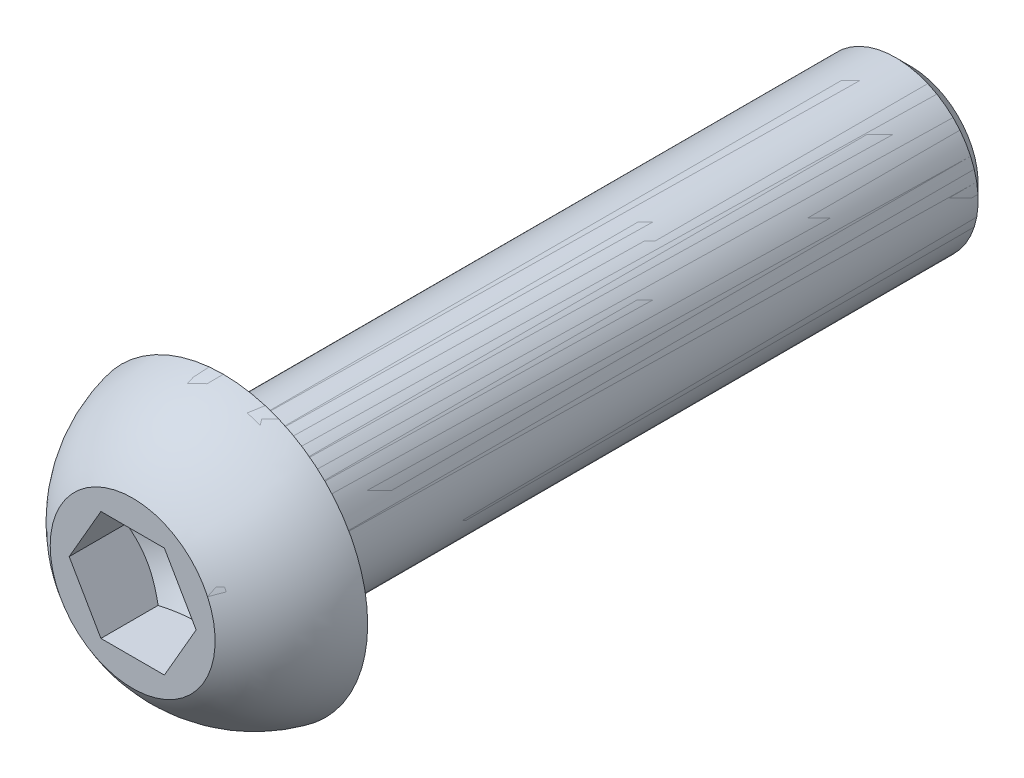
ISO-10303-21;
HEADER;
FILE_DESCRIPTION(('STEP AP214'),'2;1');
FILE_NAME('part.step','',(''),(''),'','','');
FILE_SCHEMA(('AUTOMOTIVE_DESIGN { 1 0 10303 214 1 1 1 1 }'));
ENDSEC;
DATA;
#1=APPLICATION_CONTEXT('core data for automotive mechanical design processes');
#2=APPLICATION_PROTOCOL_DEFINITION('international standard','automotive_design',2000,#1);
#3=PRODUCT_CONTEXT('',#1,'mechanical');
#4=PRODUCT('Part','Part','',(#3));
#5=PRODUCT_RELATED_PRODUCT_CATEGORY('part','',(#4));
#6=PRODUCT_DEFINITION_FORMATION('','',#4);
#7=PRODUCT_DEFINITION_CONTEXT('part definition',#1,'design');
#8=PRODUCT_DEFINITION('design','',#6,#7);
#9=PRODUCT_DEFINITION_SHAPE('','',#8);
#10=(LENGTH_UNIT() NAMED_UNIT(*) SI_UNIT(.MILLI.,.METRE.));
#11=(NAMED_UNIT(*) PLANE_ANGLE_UNIT() SI_UNIT($,.RADIAN.));
#12=(NAMED_UNIT(*) SI_UNIT($,.STERADIAN.) SOLID_ANGLE_UNIT());
#13=UNCERTAINTY_MEASURE_WITH_UNIT(LENGTH_MEASURE(1.E-05),#10,'distance_accuracy_value','');
#14=(GEOMETRIC_REPRESENTATION_CONTEXT(3) GLOBAL_UNCERTAINTY_ASSIGNED_CONTEXT((#13)) GLOBAL_UNIT_ASSIGNED_CONTEXT((#10,
#11,#12)) REPRESENTATION_CONTEXT('',''));
#15=CARTESIAN_POINT('',(0.,0.,0.));
#16=DIRECTION('',(0.,0.,1.));
#17=DIRECTION('',(1.,0.,0.));
#18=AXIS2_PLACEMENT_3D('',#15,#16,#17);
#19=CARTESIAN_POINT('',(0.,3.,3.3));
#20=DIRECTION('',(0.,0.,1.));
#21=DIRECTION('',(1.,0.,0.));
#22=AXIS2_PLACEMENT_3D('',#19,#20,#21);
#23=PLANE('',#22);
#24=CARTESIAN_POINT('',(0.,0.,3.3));
#25=DIRECTION('',(0.,0.,-1.));
#26=DIRECTION('',(-1.,0.,0.));
#27=AXIS2_PLACEMENT_3D('',#24,#25,#26);
#28=CIRCLE('',#27,3.);
#29=CARTESIAN_POINT('',(-3.,0.,3.3));
#30=VERTEX_POINT('',#29);
#31=EDGE_CURVE('P0_E449',#30,#30,#28,.T.);
#32=ORIENTED_EDGE('',*,*,#31,.F.);
#33=EDGE_LOOP('',(#32));
#34=FACE_BOUND('',#33,.T.);
#35=DIRECTION('',(1.,0.,0.));
#36=VECTOR('',#35,1.);
#37=CARTESIAN_POINT('',(-1.1547,1.99999906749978,3.3));
#38=LINE('',#37,#36);
#39=CARTESIAN_POINT('',(-1.1547,1.99999906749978,3.3));
#40=VERTEX_POINT('',#39);
#41=CARTESIAN_POINT('',(1.1547,1.99999906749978,3.3));
#42=VERTEX_POINT('',#41);
#43=EDGE_CURVE('P0_E431',#40,#42,#38,.T.);
#44=ORIENTED_EDGE('',*,*,#43,.T.);
#45=DIRECTION('',(0.5,-0.866025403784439,0.));
#46=VECTOR('',#45,1.);
#47=CARTESIAN_POINT('',(1.1547,1.99999906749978,3.3));
#48=LINE('',#47,#46);
#49=CARTESIAN_POINT('',(2.3094,0.,3.3));
#50=VERTEX_POINT('',#49);
#51=EDGE_CURVE('P0_E370',#42,#50,#48,.T.);
#52=ORIENTED_EDGE('',*,*,#51,.T.);
#53=DIRECTION('',(-0.5,-0.866025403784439,0.));
#54=VECTOR('',#53,1.);
#55=CARTESIAN_POINT('',(2.3094,0.,3.3));
#56=LINE('',#55,#54);
#57=CARTESIAN_POINT('',(1.1547,-1.99999906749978,3.3));
#58=VERTEX_POINT('',#57);
#59=EDGE_CURVE('P0_E500',#50,#58,#56,.T.);
#60=ORIENTED_EDGE('',*,*,#59,.T.);
#61=DIRECTION('',(-1.,0.,0.));
#62=VECTOR('',#61,1.);
#63=CARTESIAN_POINT('',(1.1547,-1.99999906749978,3.3));
#64=LINE('',#63,#62);
#65=CARTESIAN_POINT('',(-1.1547,-1.99999906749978,3.3));
#66=VERTEX_POINT('',#65);
#67=EDGE_CURVE('P0_E550',#58,#66,#64,.T.);
#68=ORIENTED_EDGE('',*,*,#67,.T.);
#69=DIRECTION('',(-0.5,0.866025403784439,0.));
#70=VECTOR('',#69,1.);
#71=CARTESIAN_POINT('',(-1.1547,-1.99999906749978,3.3));
#72=LINE('',#71,#70);
#73=CARTESIAN_POINT('',(-2.3094,0.,3.3));
#74=VERTEX_POINT('',#73);
#75=EDGE_CURVE('P0_E548',#66,#74,#72,.T.);
#76=ORIENTED_EDGE('',*,*,#75,.T.);
#77=DIRECTION('',(0.5,0.866025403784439,0.));
#78=VECTOR('',#77,1.);
#79=CARTESIAN_POINT('',(-2.3094,0.,3.3));
#80=LINE('',#79,#78);
#81=EDGE_CURVE('P0_E435',#74,#40,#80,.T.);
#82=ORIENTED_EDGE('',*,*,#81,.T.);
#83=EDGE_LOOP('',(#44,#52,#60,#68,#76,#82));
#84=FACE_BOUND('',#83,.T.);
#85=ADVANCED_FACE('P0_F355',(#34,#84),#23,.T.);
#86=CARTESIAN_POINT('',(0.,0.,-25.));
#87=DIRECTION('',(0.,0.,1.));
#88=DIRECTION('',(1.,0.,0.));
#89=AXIS2_PLACEMENT_3D('',#86,#87,#88);
#90=CONICAL_SURFACE('',#89,2.45875,0.785398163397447);
#91=CARTESIAN_POINT('',(0.,0.,-24.45875));
#92=DIRECTION('',(0.,0.,-1.));
#93=DIRECTION('',(-1.,0.,0.));
#94=AXIS2_PLACEMENT_3D('',#91,#92,#93);
#95=CIRCLE('',#94,3.);
#96=CARTESIAN_POINT('',(-3.,0.,-24.45875));
#97=VERTEX_POINT('',#96);
#98=EDGE_CURVE('P0_E11',#97,#97,#95,.T.);
#99=ORIENTED_EDGE('',*,*,#98,.T.);
#100=EDGE_LOOP('',(#99));
#101=FACE_BOUND('',#100,.T.);
#102=CARTESIAN_POINT('',(0.,0.,-25.));
#103=DIRECTION('',(0.,0.,-1.));
#104=DIRECTION('',(-1.,0.,0.));
#105=AXIS2_PLACEMENT_3D('',#102,#103,#104);
#106=CIRCLE('',#105,2.45875);
#107=CARTESIAN_POINT('',(-2.45875,0.,-25.));
#108=VERTEX_POINT('',#107);
#109=EDGE_CURVE('P0_E446',#108,#108,#106,.T.);
#110=ORIENTED_EDGE('',*,*,#109,.F.);
#111=EDGE_LOOP('',(#110));
#112=FACE_BOUND('',#111,.T.);
#113=ADVANCED_FACE('P0_F357',(#101,#112),#90,.T.);
#114=CARTESIAN_POINT('',(0.,0.,-25.));
#115=DIRECTION('',(0.,0.,-1.));
#116=DIRECTION('',(-1.,0.,0.));
#117=AXIS2_PLACEMENT_3D('',#114,#115,#116);
#118=CYLINDRICAL_SURFACE('',#117,3.);
#119=CARTESIAN_POINT('',(0.,0.,0.));
#120=DIRECTION('',(0.,0.,-1.));
#121=DIRECTION('',(-1.,0.,0.));
#122=AXIS2_PLACEMENT_3D('',#119,#120,#121);
#123=CIRCLE('',#122,3.);
#124=CARTESIAN_POINT('',(-3.,0.,0.));
#125=VERTEX_POINT('',#124);
#126=EDGE_CURVE('P0_E363',#125,#125,#123,.T.);
#127=ORIENTED_EDGE('',*,*,#126,.T.);
#128=EDGE_LOOP('',(#127));
#129=FACE_BOUND('',#128,.T.);
#130=ORIENTED_EDGE('',*,*,#98,.F.);
#131=EDGE_LOOP('',(#130));
#132=FACE_BOUND('',#131,.T.);
#133=ADVANCED_FACE('P0_F457',(#129,#132),#118,.T.);
#134=CARTESIAN_POINT('',(0.,3.,0.));
#135=DIRECTION('',(0.,0.,-1.));
#136=DIRECTION('',(-1.,0.,0.));
#137=AXIS2_PLACEMENT_3D('',#134,#135,#136);
#138=PLANE('',#137);
#139=CARTESIAN_POINT('',(0.,0.,0.));
#140=DIRECTION('',(0.,0.,-1.));
#141=DIRECTION('',(-1.,0.,0.));
#142=AXIS2_PLACEMENT_3D('',#139,#140,#141);
#143=CIRCLE('',#142,5.25);
#144=CARTESIAN_POINT('',(-5.25,0.,0.));
#145=VERTEX_POINT('',#144);
#146=EDGE_CURVE('P0_E452',#145,#145,#143,.T.);
#147=ORIENTED_EDGE('',*,*,#146,.T.);
#148=EDGE_LOOP('',(#147));
#149=FACE_BOUND('',#148,.T.);
#150=ORIENTED_EDGE('',*,*,#126,.F.);
#151=EDGE_LOOP('',(#150));
#152=FACE_BOUND('',#151,.T.);
#153=ADVANCED_FACE('P0_F460',(#149,#152),#138,.T.);
#154=CARTESIAN_POINT('',(0.,0.,-1.08519463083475));
#155=DIRECTION('',(0.,0.,-1.));
#156=DIRECTION('',(-1.,0.,0.));
#157=AXIS2_PLACEMENT_3D('',#154,#155,#156);
#158=DEGENERATE_TOROIDAL_SURFACE('',#157,0.113381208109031,5.25,.T.);
#159=ORIENTED_EDGE('',*,*,#31,.T.);
#160=EDGE_LOOP('',(#159));
#161=FACE_BOUND('',#160,.T.);
#162=ORIENTED_EDGE('',*,*,#146,.F.);
#163=EDGE_LOOP('',(#162));
#164=FACE_BOUND('',#163,.T.);
#165=ADVANCED_FACE('P0_F462',(#161,#164),#158,.T.);
#166=CARTESIAN_POINT('',(0.,0.,-25.));
#167=DIRECTION('',(0.,0.,-1.));
#168=DIRECTION('',(-1.,0.,0.));
#169=AXIS2_PLACEMENT_3D('',#166,#167,#168);
#170=PLANE('',#169);
#171=ORIENTED_EDGE('',*,*,#109,.T.);
#172=EDGE_LOOP('',(#171));
#173=FACE_BOUND('',#172,.T.);
#174=ADVANCED_FACE('P0_F469',(#173),#170,.T.);
#175=CARTESIAN_POINT('',(1.1547,1.99999906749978,-0.113332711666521));
#176=DIRECTION('',(-0.866025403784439,-0.5,0.));
#177=DIRECTION('',(-0.5,0.866025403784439,0.));
#178=AXIS2_PLACEMENT_3D('',#175,#176,#177);
#179=PLANE('',#178);
#180=DIRECTION('',(0.,0.,1.));
#181=VECTOR('',#180,1.);
#182=CARTESIAN_POINT('',(2.3094,0.,-0.113332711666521));
#183=LINE('',#182,#181);
#184=CARTESIAN_POINT('',(2.3094,0.,1.22));
#185=VERTEX_POINT('',#184);
#186=EDGE_CURVE('P0_E444',#185,#50,#183,.T.);
#187=ORIENTED_EDGE('',*,*,#186,.T.);
#188=ORIENTED_EDGE('',*,*,#51,.F.);
#189=DIRECTION('',(0.,0.,1.));
#190=VECTOR('',#189,1.);
#191=CARTESIAN_POINT('',(1.1547,1.99999906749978,-0.113332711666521));
#192=LINE('',#191,#190);
#193=CARTESIAN_POINT('',(1.1547,1.99999906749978,1.22));
#194=VERTEX_POINT('',#193);
#195=EDGE_CURVE('P0_E425',#194,#42,#192,.T.);
#196=ORIENTED_EDGE('',*,*,#195,.F.);
#197=CARTESIAN_POINT('',(2.30940011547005,-2.00000000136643E-07,1.22000006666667));
#198=CARTESIAN_POINT('',(2.25865804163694,0.0878876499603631,1.19069561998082));
#199=CARTESIAN_POINT('',(2.20747796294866,0.176534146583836,1.16404475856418));
#200=CARTESIAN_POINT('',(2.10423165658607,0.355361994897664,1.11752647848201));
#201=CARTESIAN_POINT('',(2.0521635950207,0.445546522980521,1.09767551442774));
#202=CARTESIAN_POINT('',(1.94867272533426,0.624797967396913,1.06677605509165));
#203=CARTESIAN_POINT('',(1.89726583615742,0.713837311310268,1.05552188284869));
#204=CARTESIAN_POINT('',(1.79421029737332,0.892334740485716,1.04208925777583));
#205=CARTESIAN_POINT('',(1.74256202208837,0.981792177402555,1.03989967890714));
#206=CARTESIAN_POINT('',(1.64606274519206,1.14893382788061,1.04446636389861));
#207=CARTESIAN_POINT('',(1.60119726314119,1.2266431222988,1.05010135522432));
#208=CARTESIAN_POINT('',(1.51175858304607,1.38155546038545,1.06795736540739));
#209=CARTESIAN_POINT('',(1.46718569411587,1.45875796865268,1.08018447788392));
#210=CARTESIAN_POINT('',(1.37756276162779,1.61398944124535,1.11074989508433));
#211=CARTESIAN_POINT('',(1.3325240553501,1.69199876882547,1.12921770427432));
#212=CARTESIAN_POINT('',(1.2431182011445,1.84685425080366,1.17113182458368));
#213=CARTESIAN_POINT('',(1.19874990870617,1.92370238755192,1.19456829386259));
#214=CARTESIAN_POINT('',(1.15469988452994,1.99999926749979,1.22000006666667));
#215=B_SPLINE_CURVE_WITH_KNOTS('',3,(#197,#198,#199,#200,#201,#202,#203,#204,#205,#206,#207,
#208,#209,#210,#211,#212,#213,#214),.UNSPECIFIED.,.F.,.F.,(4,2,2,2,2,2,2,2,4),(0.,
0.317015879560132,0.634793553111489,0.944707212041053,1.25424036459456,1.52370723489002,
1.79342362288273,2.06912103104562,2.3442773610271),.UNSPECIFIED.);
#216=EDGE_CURVE('P0_E418',#185,#194,#215,.T.);
#217=ORIENTED_EDGE('',*,*,#216,.F.);
#218=EDGE_LOOP('',(#187,#188,#196,#217));
#219=FACE_BOUND('',#218,.T.);
#220=ADVANCED_FACE('P0_F426',(#219),#179,.T.);
#221=CARTESIAN_POINT('',(2.3094,0.,-0.113332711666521));
#222=DIRECTION('',(-0.866025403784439,0.5,0.));
#223=DIRECTION('',(0.5,0.866025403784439,0.));
#224=AXIS2_PLACEMENT_3D('',#221,#222,#223);
#225=PLANE('',#224);
#226=DIRECTION('',(0.,0.,1.));
#227=VECTOR('',#226,1.);
#228=CARTESIAN_POINT('',(1.1547,-1.99999906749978,-0.113332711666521));
#229=LINE('',#228,#227);
#230=CARTESIAN_POINT('',(1.1547,-1.99999906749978,1.22));
#231=VERTEX_POINT('',#230);
#232=EDGE_CURVE('P0_E442',#231,#58,#229,.T.);
#233=ORIENTED_EDGE('',*,*,#232,.T.);
#234=ORIENTED_EDGE('',*,*,#59,.F.);
#235=ORIENTED_EDGE('',*,*,#186,.F.);
#236=CARTESIAN_POINT('',(1.15469988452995,-1.99999926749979,1.22000006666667));
#237=CARTESIAN_POINT('',(1.20544195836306,-1.91211141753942,1.19069561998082));
#238=CARTESIAN_POINT('',(1.25662203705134,-1.82346492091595,1.16404475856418));
#239=CARTESIAN_POINT('',(1.35986834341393,-1.64463707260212,1.11752647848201));
#240=CARTESIAN_POINT('',(1.41193640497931,-1.55445254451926,1.09767551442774));
#241=CARTESIAN_POINT('',(1.51542727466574,-1.37520110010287,1.06677605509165));
#242=CARTESIAN_POINT('',(1.56683416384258,-1.28616175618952,1.05552188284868));
#243=CARTESIAN_POINT('',(1.66988970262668,-1.10766432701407,1.04208925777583));
#244=CARTESIAN_POINT('',(1.72153797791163,-1.01820689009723,1.03989967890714));
#245=CARTESIAN_POINT('',(1.81803725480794,-0.851065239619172,1.04446636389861));
#246=CARTESIAN_POINT('',(1.86290273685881,-0.773355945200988,1.05010135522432));
#247=CARTESIAN_POINT('',(1.95234141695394,-0.618443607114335,1.06795736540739));
#248=CARTESIAN_POINT('',(1.99691430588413,-0.541241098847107,1.08018447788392));
#249=CARTESIAN_POINT('',(2.08653723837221,-0.386009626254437,1.11074989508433));
#250=CARTESIAN_POINT('',(2.1315759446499,-0.30800029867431,1.12921770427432));
#251=CARTESIAN_POINT('',(2.2209817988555,-0.153144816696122,1.17113182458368));
#252=CARTESIAN_POINT('',(2.26535009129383,-0.0762966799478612,1.19456829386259));
#253=CARTESIAN_POINT('',(2.30940011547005,1.99999999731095E-07,1.22000006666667));
#254=B_SPLINE_CURVE_WITH_KNOTS('',3,(#236,#237,#238,#239,#240,#241,#242,#243,#244,#245,#246,
#247,#248,#249,#250,#251,#252,#253),.UNSPECIFIED.,.F.,.F.,(4,2,2,2,2,2,2,2,4),(0.,
0.317015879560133,0.63479355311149,0.944707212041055,1.25424036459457,1.52370723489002,
1.79342362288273,2.06912103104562,2.3442773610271),.UNSPECIFIED.);
#255=EDGE_CURVE('P0_E422',#231,#185,#254,.T.);
#256=ORIENTED_EDGE('',*,*,#255,.F.);
#257=EDGE_LOOP('',(#233,#234,#235,#256));
#258=FACE_BOUND('',#257,.T.);
#259=ADVANCED_FACE('P0_F488',(#258),#225,.T.);
#260=CARTESIAN_POINT('',(1.1547,-1.99999906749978,-0.113332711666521));
#261=DIRECTION('',(0.,1.,0.));
#262=DIRECTION('',(1.,0.,0.));
#263=AXIS2_PLACEMENT_3D('',#260,#261,#262);
#264=PLANE('',#263);
#265=DIRECTION('',(0.,0.,1.));
#266=VECTOR('',#265,1.);
#267=CARTESIAN_POINT('',(-1.1547,-1.99999906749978,-0.113332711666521));
#268=LINE('',#267,#266);
#269=CARTESIAN_POINT('',(-1.1547,-1.99999906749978,1.22));
#270=VERTEX_POINT('',#269);
#271=EDGE_CURVE('P0_E440',#270,#66,#268,.T.);
#272=ORIENTED_EDGE('',*,*,#271,.T.);
#273=ORIENTED_EDGE('',*,*,#67,.F.);
#274=ORIENTED_EDGE('',*,*,#232,.F.);
#275=CARTESIAN_POINT('',(-2.99028884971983,-1.99999906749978,1.96367023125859));
#276=CARTESIAN_POINT('',(-2.90392200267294,-1.99999906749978,1.92223468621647));
#277=CARTESIAN_POINT('',(-2.81734475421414,-1.99999906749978,1.88122952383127));
#278=CARTESIAN_POINT('',(-2.64365731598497,-1.99999906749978,1.80032411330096));
#279=CARTESIAN_POINT('',(-2.55654703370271,-1.99999906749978,1.76042406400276));
#280=CARTESIAN_POINT('',(-2.38118192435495,-1.99999906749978,1.68175012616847));
#281=CARTESIAN_POINT('',(-2.29292335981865,-1.99999906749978,1.64298453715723));
#282=CARTESIAN_POINT('',(-2.11566562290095,-1.99999906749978,1.56719170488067));
#283=CARTESIAN_POINT('',(-2.02666648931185,-1.99999906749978,1.53016437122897));
#284=CARTESIAN_POINT('',(-1.84544164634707,-1.99999906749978,1.45736806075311));
#285=CARTESIAN_POINT('',(-1.75319241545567,-1.99999906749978,1.42165729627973));
#286=CARTESIAN_POINT('',(-1.56757813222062,-1.99999906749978,1.35320478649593));
#287=CARTESIAN_POINT('',(-1.47421295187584,-1.99999906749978,1.32046338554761));
#288=CARTESIAN_POINT('',(-1.28643386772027,-1.99999906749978,1.25888591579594));
#289=CARTESIAN_POINT('',(-1.19202295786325,-1.99999906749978,1.23004081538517));
#290=CARTESIAN_POINT('',(-1.00184812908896,-1.99999906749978,1.17724234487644));
#291=CARTESIAN_POINT('',(-0.906084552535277,-1.99999906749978,1.15328775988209));
#292=CARTESIAN_POINT('',(-0.713403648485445,-1.99999906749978,1.11154750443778));
#293=CARTESIAN_POINT('',(-0.616489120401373,-1.99999906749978,1.09374916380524));
#294=CARTESIAN_POINT('',(-0.421576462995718,-1.99999906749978,1.06548602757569));
#295=CARTESIAN_POINT('',(-0.323578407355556,-1.99999906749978,1.05502073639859));
#296=CARTESIAN_POINT('',(-0.12821235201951,-1.99999906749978,1.04239776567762));
#297=CARTESIAN_POINT('',(-0.0308508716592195,-1.99999906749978,1.04014205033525));
#298=CARTESIAN_POINT('',(0.163710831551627,-1.99999906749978,1.04386608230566));
#299=CARTESIAN_POINT('',(0.260911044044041,-1.99999906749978,1.04984633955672));
#300=CARTESIAN_POINT('',(0.500738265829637,-1.99999906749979,1.07423686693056));
#301=CARTESIAN_POINT('',(0.64290057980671,-1.99999906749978,1.0972180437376));
#302=CARTESIAN_POINT('',(0.924460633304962,-1.99999906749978,1.15647980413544));
#303=CARTESIAN_POINT('',(1.06385482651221,-1.99999906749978,1.19277641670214));
#304=CARTESIAN_POINT('',(1.27233418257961,-1.99999906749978,1.25477991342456));
#305=CARTESIAN_POINT('',(1.3424969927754,-1.99999906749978,1.27699669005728));
#306=CARTESIAN_POINT('',(1.4820922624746,-1.99999906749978,1.32348542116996));
#307=CARTESIAN_POINT('',(1.55152514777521,-1.99999906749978,1.34775609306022));
#308=CARTESIAN_POINT('',(1.68975335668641,-1.99999906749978,1.39800013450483));
#309=CARTESIAN_POINT('',(1.75854879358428,-1.99999906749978,1.4239731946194));
#310=CARTESIAN_POINT('',(1.8955975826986,-1.99999906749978,1.47734107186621));
#311=CARTESIAN_POINT('',(1.96385084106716,-1.99999906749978,1.50473612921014));
#312=CARTESIAN_POINT('',(2.13806939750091,-1.99999906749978,1.5764177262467));
#313=CARTESIAN_POINT('',(2.24368634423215,-1.99999906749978,1.62155001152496));
#314=CARTESIAN_POINT('',(2.45396648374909,-1.99999906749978,1.71399021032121));
#315=CARTESIAN_POINT('',(2.55862960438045,-1.99999906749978,1.76129828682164));
#316=CARTESIAN_POINT('',(2.87150603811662,-1.99999906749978,1.90571921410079));
#317=CARTESIAN_POINT('',(3.07857147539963,-1.99999906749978,2.00531395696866));
#318=CARTESIAN_POINT('',(3.49093332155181,-1.99999906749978,2.2086804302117));
#319=CARTESIAN_POINT('',(3.69622724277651,-1.99999906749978,2.31245714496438));
#320=CARTESIAN_POINT('',(4.10540852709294,-1.99999906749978,2.52267901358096));
#321=CARTESIAN_POINT('',(4.30929606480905,-1.99999906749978,2.62912382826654));
#322=CARTESIAN_POINT('',(4.69689950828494,-1.99999906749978,2.83371795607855));
#323=CARTESIAN_POINT('',(4.8807029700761,-1.99999906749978,2.93170196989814));
#324=CARTESIAN_POINT('',(5.24771864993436,-1.99999906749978,3.12878643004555));
#325=CARTESIAN_POINT('',(5.43093084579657,-1.99999906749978,3.22788691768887));
#326=CARTESIAN_POINT('',(5.79643429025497,-1.99999906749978,3.42667121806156));
#327=CARTESIAN_POINT('',(5.97872669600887,-1.99999906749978,3.52635290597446));
#328=CARTESIAN_POINT('',(6.34294295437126,-1.99999906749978,3.72636506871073));
#329=CARTESIAN_POINT('',(6.52486682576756,-1.99999906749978,3.82669550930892));
#330=CARTESIAN_POINT('',(6.70665829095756,-1.99999906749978,3.92726384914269));
#331=B_SPLINE_CURVE_WITH_KNOTS('',3,(#275,#276,#277,#278,#279,#280,#281,#282,#283,#284,#285,
#286,#287,#288,#289,#290,#291,#292,#293,#294,#295,#296,#297,#298,#299,#300,#301,#302,#303,#304,
#305,#306,#307,#308,#309,#310,#311,#312,#313,#314,#315,#316,#317,#318,#319,#320,#321,#322,#323,
#324,#325,#326,#327,#328,#329,#330),.UNSPECIFIED.,.F.,.F.,(4,2,2,2,2,2,2,2,2,2,2,2,2,2,2,2,2,2,
2,2,2,2,2,2,2,2,2,4),(0.,0.287380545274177,0.574812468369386,0.863987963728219,1.15314840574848,
1.44986914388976,1.746624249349,2.04267922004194,2.33866055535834,2.63402905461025,
2.92937759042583,3.22118738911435,3.51301525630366,3.94415234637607,4.37581014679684,
4.59657452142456,4.81720203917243,5.03778956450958,5.25841447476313,5.6029464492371,
5.94750427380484,6.63673372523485,7.32681046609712,8.01679992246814,8.64166451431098,
9.26655230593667,9.88985069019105,10.5131164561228),.UNSPECIFIED.);
#332=EDGE_CURVE('P0_E525',#270,#231,#331,.T.);
#333=ORIENTED_EDGE('',*,*,#332,.F.);
#334=EDGE_LOOP('',(#272,#273,#274,#333));
#335=FACE_BOUND('',#334,.T.);
#336=ADVANCED_FACE('P0_F529',(#335),#264,.T.);
#337=CARTESIAN_POINT('',(-1.1547,-1.99999906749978,-0.113332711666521));
#338=DIRECTION('',(0.866025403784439,0.5,0.));
#339=DIRECTION('',(0.5,-0.866025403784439,0.));
#340=AXIS2_PLACEMENT_3D('',#337,#338,#339);
#341=PLANE('',#340);
#342=DIRECTION('',(0.,0.,1.));
#343=VECTOR('',#342,1.);
#344=CARTESIAN_POINT('',(-2.3094,0.,-0.113332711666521));
#345=LINE('',#344,#343);
#346=CARTESIAN_POINT('',(-2.3094,0.,1.22));
#347=VERTEX_POINT('',#346);
#348=EDGE_CURVE('P0_E433',#347,#74,#345,.T.);
#349=ORIENTED_EDGE('',*,*,#348,.T.);
#350=ORIENTED_EDGE('',*,*,#75,.F.);
#351=ORIENTED_EDGE('',*,*,#271,.F.);
#352=CARTESIAN_POINT('',(-2.30940011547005,2.00000000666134E-07,1.22000006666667));
#353=CARTESIAN_POINT('',(-2.25865804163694,-0.0878876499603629,1.19069561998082));
#354=CARTESIAN_POINT('',(-2.20747796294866,-0.176534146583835,1.16404475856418));
#355=CARTESIAN_POINT('',(-2.10423165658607,-0.355361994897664,1.11752647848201));
#356=CARTESIAN_POINT('',(-2.0521635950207,-0.44554652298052,1.09767551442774));
#357=CARTESIAN_POINT('',(-1.94867272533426,-0.624797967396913,1.06677605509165));
#358=CARTESIAN_POINT('',(-1.89726583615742,-0.713837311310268,1.05552188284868));
#359=CARTESIAN_POINT('',(-1.79421029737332,-0.892334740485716,1.04208925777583));
#360=CARTESIAN_POINT('',(-1.74256202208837,-0.981792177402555,1.03989967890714));
#361=CARTESIAN_POINT('',(-1.64606274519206,-1.14893382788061,1.04446636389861));
#362=CARTESIAN_POINT('',(-1.60119726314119,-1.2266431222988,1.05010135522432));
#363=CARTESIAN_POINT('',(-1.51175858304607,-1.38155546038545,1.06795736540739));
#364=CARTESIAN_POINT('',(-1.46718569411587,-1.45875796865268,1.08018447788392));
#365=CARTESIAN_POINT('',(-1.37756276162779,-1.61398944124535,1.11074989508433));
#366=CARTESIAN_POINT('',(-1.3325240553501,-1.69199876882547,1.12921770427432));
#367=CARTESIAN_POINT('',(-1.2431182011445,-1.84685425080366,1.17113182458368));
#368=CARTESIAN_POINT('',(-1.19874990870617,-1.92370238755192,1.19456829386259));
#369=CARTESIAN_POINT('',(-1.15469988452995,-1.99999926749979,1.22000006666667));
#370=B_SPLINE_CURVE_WITH_KNOTS('',3,(#352,#353,#354,#355,#356,#357,#358,#359,#360,#361,#362,
#363,#364,#365,#366,#367,#368,#369),.UNSPECIFIED.,.F.,.F.,(4,2,2,2,2,2,2,2,4),(0.,
0.317015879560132,0.634793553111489,0.944707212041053,1.25424036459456,1.52370723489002,
1.79342362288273,2.06912103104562,2.3442773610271),.UNSPECIFIED.);
#371=EDGE_CURVE('P0_E520',#347,#270,#370,.T.);
#372=ORIENTED_EDGE('',*,*,#371,.F.);
#373=EDGE_LOOP('',(#349,#350,#351,#372));
#374=FACE_BOUND('',#373,.T.);
#375=ADVANCED_FACE('P0_F532',(#374),#341,.T.);
#376=CARTESIAN_POINT('',(-2.3094,0.,-0.113332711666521));
#377=DIRECTION('',(0.866025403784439,-0.5,0.));
#378=DIRECTION('',(-0.5,-0.866025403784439,0.));
#379=AXIS2_PLACEMENT_3D('',#376,#377,#378);
#380=PLANE('',#379);
#381=DIRECTION('',(0.,0.,1.));
#382=VECTOR('',#381,1.);
#383=CARTESIAN_POINT('',(-1.1547,1.99999906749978,-0.113332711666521));
#384=LINE('',#383,#382);
#385=CARTESIAN_POINT('',(-1.1547,1.99999906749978,1.22));
#386=VERTEX_POINT('',#385);
#387=EDGE_CURVE('P0_E430',#386,#40,#384,.T.);
#388=ORIENTED_EDGE('',*,*,#387,.T.);
#389=ORIENTED_EDGE('',*,*,#81,.F.);
#390=ORIENTED_EDGE('',*,*,#348,.F.);
#391=CARTESIAN_POINT('',(-1.15469988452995,1.99999926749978,1.22000006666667));
#392=CARTESIAN_POINT('',(-1.20544195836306,1.91211141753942,1.19069561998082));
#393=CARTESIAN_POINT('',(-1.25662203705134,1.82346492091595,1.16404475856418));
#394=CARTESIAN_POINT('',(-1.35986834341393,1.64463707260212,1.11752647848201));
#395=CARTESIAN_POINT('',(-1.41193640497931,1.55445254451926,1.09767551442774));
#396=CARTESIAN_POINT('',(-1.51542727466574,1.37520110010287,1.06677605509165));
#397=CARTESIAN_POINT('',(-1.56683416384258,1.28616175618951,1.05552188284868));
#398=CARTESIAN_POINT('',(-1.66988970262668,1.10766432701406,1.04208925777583));
#399=CARTESIAN_POINT('',(-1.72153797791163,1.01820689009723,1.03989967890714));
#400=CARTESIAN_POINT('',(-1.81803725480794,0.851065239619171,1.04446636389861));
#401=CARTESIAN_POINT('',(-1.86290273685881,0.773355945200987,1.05010135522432));
#402=CARTESIAN_POINT('',(-1.95234141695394,0.618443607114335,1.06795736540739));
#403=CARTESIAN_POINT('',(-1.99691430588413,0.541241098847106,1.08018447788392));
#404=CARTESIAN_POINT('',(-2.08653723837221,0.386009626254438,1.11074989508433));
#405=CARTESIAN_POINT('',(-2.1315759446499,0.308000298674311,1.12921770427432));
#406=CARTESIAN_POINT('',(-2.2209817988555,0.153144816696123,1.17113182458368));
#407=CARTESIAN_POINT('',(-2.26535009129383,0.0762966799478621,1.19456829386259));
#408=CARTESIAN_POINT('',(-2.30940011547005,-1.999999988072E-07,1.22000006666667));
#409=B_SPLINE_CURVE_WITH_KNOTS('',3,(#391,#392,#393,#394,#395,#396,#397,#398,#399,#400,#401,
#402,#403,#404,#405,#406,#407,#408),.UNSPECIFIED.,.F.,.F.,(4,2,2,2,2,2,2,2,4),(0.,
0.317015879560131,0.634793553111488,0.944707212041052,1.25424036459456,1.52370723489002,
1.79342362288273,2.06912103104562,2.34427736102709),.UNSPECIFIED.);
#410=EDGE_CURVE('P0_E378',#386,#347,#409,.T.);
#411=ORIENTED_EDGE('',*,*,#410,.F.);
#412=EDGE_LOOP('',(#388,#389,#390,#411));
#413=FACE_BOUND('',#412,.T.);
#414=ADVANCED_FACE('P0_F536',(#413),#380,.T.);
#415=CARTESIAN_POINT('',(-1.1547,1.99999906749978,-0.113332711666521));
#416=DIRECTION('',(0.,-1.,0.));
#417=DIRECTION('',(-1.,0.,0.));
#418=AXIS2_PLACEMENT_3D('',#415,#416,#417);
#419=PLANE('',#418);
#420=ORIENTED_EDGE('',*,*,#195,.T.);
#421=ORIENTED_EDGE('',*,*,#43,.F.);
#422=ORIENTED_EDGE('',*,*,#387,.F.);
#423=CARTESIAN_POINT('',(-2.99028884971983,1.99999906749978,1.96367023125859));
#424=CARTESIAN_POINT('',(-2.90392200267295,1.99999906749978,1.92223468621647));
#425=CARTESIAN_POINT('',(-2.81734475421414,1.99999906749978,1.88122952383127));
#426=CARTESIAN_POINT('',(-2.64365731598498,1.99999906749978,1.80032411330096));
#427=CARTESIAN_POINT('',(-2.55654703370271,1.99999906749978,1.76042406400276));
#428=CARTESIAN_POINT('',(-2.38118192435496,1.99999906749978,1.68175012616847));
#429=CARTESIAN_POINT('',(-2.29292335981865,1.99999906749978,1.64298453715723));
#430=CARTESIAN_POINT('',(-2.11566562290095,1.99999906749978,1.56719170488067));
#431=CARTESIAN_POINT('',(-2.02666648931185,1.99999906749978,1.53016437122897));
#432=CARTESIAN_POINT('',(-1.84544164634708,1.99999906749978,1.45736806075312));
#433=CARTESIAN_POINT('',(-1.75319241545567,1.99999906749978,1.42165729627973));
#434=CARTESIAN_POINT('',(-1.56757813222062,1.99999906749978,1.35320478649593));
#435=CARTESIAN_POINT('',(-1.47421295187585,1.99999906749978,1.32046338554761));
#436=CARTESIAN_POINT('',(-1.28643386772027,1.99999906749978,1.25888591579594));
#437=CARTESIAN_POINT('',(-1.19202295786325,1.99999906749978,1.23004081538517));
#438=CARTESIAN_POINT('',(-1.00184812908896,1.99999906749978,1.17724234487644));
#439=CARTESIAN_POINT('',(-0.906084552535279,1.99999906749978,1.15328775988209));
#440=CARTESIAN_POINT('',(-0.713403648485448,1.99999906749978,1.11154750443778));
#441=CARTESIAN_POINT('',(-0.616489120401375,1.99999906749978,1.09374916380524));
#442=CARTESIAN_POINT('',(-0.42157646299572,1.99999906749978,1.06548602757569));
#443=CARTESIAN_POINT('',(-0.323578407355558,1.99999906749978,1.05502073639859));
#444=CARTESIAN_POINT('',(-0.128212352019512,1.99999906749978,1.04239776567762));
#445=CARTESIAN_POINT('',(-0.0308508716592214,1.99999906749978,1.04014205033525));
#446=CARTESIAN_POINT('',(0.163710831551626,1.99999906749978,1.04386608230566));
#447=CARTESIAN_POINT('',(0.26091104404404,1.99999906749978,1.04984633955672));
#448=CARTESIAN_POINT('',(0.500738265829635,1.99999906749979,1.07423686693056));
#449=CARTESIAN_POINT('',(0.642900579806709,1.99999906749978,1.0972180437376));
#450=CARTESIAN_POINT('',(0.924460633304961,1.99999906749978,1.15647980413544));
#451=CARTESIAN_POINT('',(1.06385482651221,1.99999906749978,1.19277641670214));
#452=CARTESIAN_POINT('',(1.27233418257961,1.99999906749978,1.25477991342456));
#453=CARTESIAN_POINT('',(1.3424969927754,1.99999906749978,1.27699669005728));
#454=CARTESIAN_POINT('',(1.4820922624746,1.99999906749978,1.32348542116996));
#455=CARTESIAN_POINT('',(1.55152514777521,1.99999906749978,1.34775609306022));
#456=CARTESIAN_POINT('',(1.68975335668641,1.99999906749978,1.39800013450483));
#457=CARTESIAN_POINT('',(1.75854879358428,1.99999906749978,1.4239731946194));
#458=CARTESIAN_POINT('',(1.8955975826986,1.99999906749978,1.47734107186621));
#459=CARTESIAN_POINT('',(1.96385084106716,1.99999906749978,1.50473612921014));
#460=CARTESIAN_POINT('',(2.13806939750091,1.99999906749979,1.5764177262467));
#461=CARTESIAN_POINT('',(2.24368634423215,1.99999906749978,1.62155001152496));
#462=CARTESIAN_POINT('',(2.45396648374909,1.99999906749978,1.71399021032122));
#463=CARTESIAN_POINT('',(2.55862960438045,1.99999906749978,1.76129828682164));
#464=CARTESIAN_POINT('',(2.87150603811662,1.99999906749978,1.90571921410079));
#465=CARTESIAN_POINT('',(3.07857147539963,1.99999906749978,2.00531395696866));
#466=CARTESIAN_POINT('',(3.49093332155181,1.99999906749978,2.2086804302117));
#467=CARTESIAN_POINT('',(3.69622724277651,1.99999906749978,2.31245714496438));
#468=CARTESIAN_POINT('',(4.10540852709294,1.99999906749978,2.52267901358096));
#469=CARTESIAN_POINT('',(4.30929606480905,1.99999906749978,2.62912382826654));
#470=CARTESIAN_POINT('',(4.69689950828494,1.99999906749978,2.83371795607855));
#471=CARTESIAN_POINT('',(4.8807029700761,1.99999906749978,2.93170196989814));
#472=CARTESIAN_POINT('',(5.24771864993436,1.99999906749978,3.12878643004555));
#473=CARTESIAN_POINT('',(5.43093084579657,1.99999906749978,3.22788691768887));
#474=CARTESIAN_POINT('',(5.79643429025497,1.99999906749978,3.42667121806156));
#475=CARTESIAN_POINT('',(5.97872669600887,1.99999906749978,3.52635290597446));
#476=CARTESIAN_POINT('',(6.34294295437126,1.99999906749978,3.72636506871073));
#477=CARTESIAN_POINT('',(6.52486682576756,1.99999906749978,3.82669550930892));
#478=CARTESIAN_POINT('',(6.70665829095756,1.99999906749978,3.92726384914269));
#479=B_SPLINE_CURVE_WITH_KNOTS('',3,(#423,#424,#425,#426,#427,#428,#429,#430,#431,#432,#433,
#434,#435,#436,#437,#438,#439,#440,#441,#442,#443,#444,#445,#446,#447,#448,#449,#450,#451,#452,
#453,#454,#455,#456,#457,#458,#459,#460,#461,#462,#463,#464,#465,#466,#467,#468,#469,#470,#471,
#472,#473,#474,#475,#476,#477,#478),.UNSPECIFIED.,.F.,.F.,(4,2,2,2,2,2,2,2,2,2,2,2,2,2,2,2,2,2,
2,2,2,2,2,2,2,2,2,4),(0.,0.287380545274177,0.574812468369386,0.86398796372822,1.15314840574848,
1.44986914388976,1.74662424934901,2.04267922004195,2.33866055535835,2.63402905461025,
2.92937759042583,3.22118738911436,3.51301525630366,3.94415234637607,4.37581014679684,
4.59657452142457,4.81720203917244,5.03778956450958,5.25841447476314,5.6029464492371,
5.94750427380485,6.63673372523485,7.32681046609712,8.01679992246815,8.64166451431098,
9.26655230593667,9.88985069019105,10.5131164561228),.UNSPECIFIED.);
#480=EDGE_CURVE('P0_E419',#194,#386,#479,.F.);
#481=ORIENTED_EDGE('',*,*,#480,.F.);
#482=EDGE_LOOP('',(#420,#421,#422,#481));
#483=FACE_BOUND('',#482,.T.);
#484=ADVANCED_FACE('P0_F414',(#483),#419,.T.);
#485=CARTESIAN_POINT('',(0.,0.,-0.113332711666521));
#486=DIRECTION('',(0.,0.,1.));
#487=DIRECTION('',(1.,0.,0.));
#488=AXIS2_PLACEMENT_3D('',#485,#486,#487);
#489=CONICAL_SURFACE('',#488,0.,1.0471975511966);
#490=CARTESIAN_POINT('',(0.,0.,-0.113332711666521));
#491=VERTEX_POINT('',#490);
#492=VERTEX_LOOP('',#491);
#493=FACE_BOUND('',#492,.T.);
#494=ORIENTED_EDGE('',*,*,#216,.T.);
#495=ORIENTED_EDGE('',*,*,#480,.T.);
#496=ORIENTED_EDGE('',*,*,#410,.T.);
#497=ORIENTED_EDGE('',*,*,#371,.T.);
#498=ORIENTED_EDGE('',*,*,#332,.T.);
#499=ORIENTED_EDGE('',*,*,#255,.T.);
#500=EDGE_LOOP('',(#494,#495,#496,#497,#498,#499));
#501=FACE_BOUND('',#500,.T.);
#502=ADVANCED_FACE('P0_F411',(#493,#501),#489,.F.);
#503=CLOSED_SHELL('',(#85,#113,#133,#153,#165,#174,#220,#259,#336,#375,#414,#484,#502));
#504=MANIFOLD_SOLID_BREP('P0_B2',#503);
#505=CARTESIAN_POINT('',(0.,3.,3.3));
#506=DIRECTION('',(0.,0.,1.));
#507=DIRECTION('',(1.,0.,0.));
#508=AXIS2_PLACEMENT_3D('',#505,#506,#507);
#509=PLANE('',#508);
#510=CARTESIAN_POINT('',(0.,0.,3.3));
#511=DIRECTION('',(0.,0.,-1.));
#512=DIRECTION('',(-1.,0.,0.));
#513=AXIS2_PLACEMENT_3D('',#510,#511,#512);
#514=CIRCLE('',#513,3.);
#515=CARTESIAN_POINT('',(-3.,0.,3.3));
#516=VERTEX_POINT('',#515);
#517=EDGE_CURVE('P1_E108',#516,#516,#514,.T.);
#518=ORIENTED_EDGE('',*,*,#517,.F.);
#519=EDGE_LOOP('',(#518));
#520=FACE_BOUND('',#519,.T.);
#521=DIRECTION('',(1.,0.,0.));
#522=VECTOR('',#521,1.);
#523=CARTESIAN_POINT('',(-1.1547,1.99999906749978,3.3));
#524=LINE('',#523,#522);
#525=CARTESIAN_POINT('',(-1.1547,1.99999906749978,3.3));
#526=VERTEX_POINT('',#525);
#527=CARTESIAN_POINT('',(1.1547,1.99999906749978,3.3));
#528=VERTEX_POINT('',#527);
#529=EDGE_CURVE('P1_E90',#526,#528,#524,.T.);
#530=ORIENTED_EDGE('',*,*,#529,.T.);
#531=DIRECTION('',(0.5,-0.866025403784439,0.));
#532=VECTOR('',#531,1.);
#533=CARTESIAN_POINT('',(1.1547,1.99999906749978,3.3));
#534=LINE('',#533,#532);
#535=CARTESIAN_POINT('',(2.3094,0.,3.3));
#536=VERTEX_POINT('',#535);
#537=EDGE_CURVE('P1_E30',#528,#536,#534,.T.);
#538=ORIENTED_EDGE('',*,*,#537,.T.);
#539=DIRECTION('',(-0.5,-0.866025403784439,0.));
#540=VECTOR('',#539,1.);
#541=CARTESIAN_POINT('',(2.3094,0.,3.3));
#542=LINE('',#541,#540);
#543=CARTESIAN_POINT('',(1.1547,-1.99999906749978,3.3));
#544=VERTEX_POINT('',#543);
#545=EDGE_CURVE('P1_E149',#536,#544,#542,.T.);
#546=ORIENTED_EDGE('',*,*,#545,.T.);
#547=DIRECTION('',(-1.,0.,0.));
#548=VECTOR('',#547,1.);
#549=CARTESIAN_POINT('',(1.1547,-1.99999906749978,3.3));
#550=LINE('',#549,#548);
#551=CARTESIAN_POINT('',(-1.1547,-1.99999906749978,3.3));
#552=VERTEX_POINT('',#551);
#553=EDGE_CURVE('P1_E193',#544,#552,#550,.T.);
#554=ORIENTED_EDGE('',*,*,#553,.T.);
#555=DIRECTION('',(-0.5,0.866025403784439,0.));
#556=VECTOR('',#555,1.);
#557=CARTESIAN_POINT('',(-1.1547,-1.99999906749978,3.3));
#558=LINE('',#557,#556);
#559=CARTESIAN_POINT('',(-2.3094,0.,3.3));
#560=VERTEX_POINT('',#559);
#561=EDGE_CURVE('P1_E191',#552,#560,#558,.T.);
#562=ORIENTED_EDGE('',*,*,#561,.T.);
#563=DIRECTION('',(0.5,0.866025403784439,0.));
#564=VECTOR('',#563,1.);
#565=CARTESIAN_POINT('',(-2.3094,0.,3.3));
#566=LINE('',#565,#564);
#567=EDGE_CURVE('P1_E94',#560,#526,#566,.T.);
#568=ORIENTED_EDGE('',*,*,#567,.T.);
#569=EDGE_LOOP('',(#530,#538,#546,#554,#562,#568));
#570=FACE_BOUND('',#569,.T.);
#571=ADVANCED_FACE('P1_F15',(#520,#570),#509,.T.);
#572=CARTESIAN_POINT('',(0.,0.,-25.));
#573=DIRECTION('',(0.,0.,1.));
#574=DIRECTION('',(1.,0.,0.));
#575=AXIS2_PLACEMENT_3D('',#572,#573,#574);
#576=CONICAL_SURFACE('',#575,2.45875,0.785398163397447);
#577=CARTESIAN_POINT('',(0.,0.,-24.45875));
#578=DIRECTION('',(0.,0.,-1.));
#579=DIRECTION('',(-1.,0.,0.));
#580=AXIS2_PLACEMENT_3D('',#577,#578,#579);
#581=CIRCLE('',#580,3.);
#582=CARTESIAN_POINT('',(-3.,0.,-24.45875));
#583=VERTEX_POINT('',#582);
#584=EDGE_CURVE('P1_E10',#583,#583,#581,.T.);
#585=ORIENTED_EDGE('',*,*,#584,.T.);
#586=EDGE_LOOP('',(#585));
#587=FACE_BOUND('',#586,.T.);
#588=CARTESIAN_POINT('',(0.,0.,-25.));
#589=DIRECTION('',(0.,0.,-1.));
#590=DIRECTION('',(-1.,0.,0.));
#591=AXIS2_PLACEMENT_3D('',#588,#589,#590);
#592=CIRCLE('',#591,2.45875);
#593=CARTESIAN_POINT('',(-2.45875,0.,-25.));
#594=VERTEX_POINT('',#593);
#595=EDGE_CURVE('P1_E105',#594,#594,#592,.T.);
#596=ORIENTED_EDGE('',*,*,#595,.F.);
#597=EDGE_LOOP('',(#596));
#598=FACE_BOUND('',#597,.T.);
#599=ADVANCED_FACE('P1_F17',(#587,#598),#576,.T.);
#600=CARTESIAN_POINT('',(0.,0.,-25.));
#601=DIRECTION('',(0.,0.,-1.));
#602=DIRECTION('',(-1.,0.,0.));
#603=AXIS2_PLACEMENT_3D('',#600,#601,#602);
#604=CYLINDRICAL_SURFACE('',#603,3.);
#605=CARTESIAN_POINT('',(0.,0.,0.));
#606=DIRECTION('',(0.,0.,-1.));
#607=DIRECTION('',(-1.,0.,0.));
#608=AXIS2_PLACEMENT_3D('',#605,#606,#607);
#609=CIRCLE('',#608,3.);
#610=CARTESIAN_POINT('',(-3.,0.,0.));
#611=VERTEX_POINT('',#610);
#612=EDGE_CURVE('P1_E23',#611,#611,#609,.T.);
#613=ORIENTED_EDGE('',*,*,#612,.T.);
#614=EDGE_LOOP('',(#613));
#615=FACE_BOUND('',#614,.T.);
#616=ORIENTED_EDGE('',*,*,#584,.F.);
#617=EDGE_LOOP('',(#616));
#618=FACE_BOUND('',#617,.T.);
#619=ADVANCED_FACE('P1_F116',(#615,#618),#604,.T.);
#620=CARTESIAN_POINT('',(0.,3.,0.));
#621=DIRECTION('',(0.,0.,-1.));
#622=DIRECTION('',(-1.,0.,0.));
#623=AXIS2_PLACEMENT_3D('',#620,#621,#622);
#624=PLANE('',#623);
#625=CARTESIAN_POINT('',(0.,0.,0.));
#626=DIRECTION('',(0.,0.,-1.));
#627=DIRECTION('',(-1.,0.,0.));
#628=AXIS2_PLACEMENT_3D('',#625,#626,#627);
#629=CIRCLE('',#628,5.25);
#630=CARTESIAN_POINT('',(-5.25,0.,0.));
#631=VERTEX_POINT('',#630);
#632=EDGE_CURVE('P1_E111',#631,#631,#629,.T.);
#633=ORIENTED_EDGE('',*,*,#632,.T.);
#634=EDGE_LOOP('',(#633));
#635=FACE_BOUND('',#634,.T.);
#636=ORIENTED_EDGE('',*,*,#612,.F.);
#637=EDGE_LOOP('',(#636));
#638=FACE_BOUND('',#637,.T.);
#639=ADVANCED_FACE('P1_F119',(#635,#638),#624,.T.);
#640=CARTESIAN_POINT('',(0.,0.,-1.08519463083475));
#641=DIRECTION('',(0.,0.,-1.));
#642=DIRECTION('',(-1.,0.,0.));
#643=AXIS2_PLACEMENT_3D('',#640,#641,#642);
#644=DEGENERATE_TOROIDAL_SURFACE('',#643,0.113381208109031,5.25,.T.);
#645=ORIENTED_EDGE('',*,*,#517,.T.);
#646=EDGE_LOOP('',(#645));
#647=FACE_BOUND('',#646,.T.);
#648=ORIENTED_EDGE('',*,*,#632,.F.);
#649=EDGE_LOOP('',(#648));
#650=FACE_BOUND('',#649,.T.);
#651=ADVANCED_FACE('P1_F120',(#647,#650),#644,.T.);
#652=CARTESIAN_POINT('',(0.,0.,-25.));
#653=DIRECTION('',(0.,0.,-1.));
#654=DIRECTION('',(-1.,0.,0.));
#655=AXIS2_PLACEMENT_3D('',#652,#653,#654);
#656=PLANE('',#655);
#657=ORIENTED_EDGE('',*,*,#595,.T.);
#658=EDGE_LOOP('',(#657));
#659=FACE_BOUND('',#658,.T.);
#660=ADVANCED_FACE('P1_F123',(#659),#656,.T.);
#661=CARTESIAN_POINT('',(1.1547,1.99999906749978,-0.113332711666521));
#662=DIRECTION('',(-0.866025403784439,-0.5,0.));
#663=DIRECTION('',(-0.5,0.866025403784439,0.));
#664=AXIS2_PLACEMENT_3D('',#661,#662,#663);
#665=PLANE('',#664);
#666=DIRECTION('',(0.,0.,1.));
#667=VECTOR('',#666,1.);
#668=CARTESIAN_POINT('',(2.3094,0.,-0.113332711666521));
#669=LINE('',#668,#667);
#670=CARTESIAN_POINT('',(2.3094,0.,1.22));
#671=VERTEX_POINT('',#670);
#672=EDGE_CURVE('P1_E103',#671,#536,#669,.T.);
#673=ORIENTED_EDGE('',*,*,#672,.T.);
#674=ORIENTED_EDGE('',*,*,#537,.F.);
#675=DIRECTION('',(0.,0.,1.));
#676=VECTOR('',#675,1.);
#677=CARTESIAN_POINT('',(1.1547,1.99999906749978,-0.113332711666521));
#678=LINE('',#677,#676);
#679=CARTESIAN_POINT('',(1.1547,1.99999906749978,1.22));
#680=VERTEX_POINT('',#679);
#681=EDGE_CURVE('P1_E84',#680,#528,#678,.T.);
#682=ORIENTED_EDGE('',*,*,#681,.F.);
#683=CARTESIAN_POINT('',(2.30940011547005,-2.00000000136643E-07,1.22000006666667));
#684=CARTESIAN_POINT('',(2.25865804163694,0.0878876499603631,1.19069561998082));
#685=CARTESIAN_POINT('',(2.20747796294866,0.176534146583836,1.16404475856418));
#686=CARTESIAN_POINT('',(2.10423165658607,0.355361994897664,1.11752647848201));
#687=CARTESIAN_POINT('',(2.0521635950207,0.445546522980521,1.09767551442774));
#688=CARTESIAN_POINT('',(1.94867272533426,0.624797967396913,1.06677605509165));
#689=CARTESIAN_POINT('',(1.89726583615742,0.713837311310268,1.05552188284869));
#690=CARTESIAN_POINT('',(1.79421029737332,0.892334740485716,1.04208925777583));
#691=CARTESIAN_POINT('',(1.74256202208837,0.981792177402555,1.03989967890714));
#692=CARTESIAN_POINT('',(1.64606274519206,1.14893382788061,1.04446636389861));
#693=CARTESIAN_POINT('',(1.60119726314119,1.2266431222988,1.05010135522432));
#694=CARTESIAN_POINT('',(1.51175858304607,1.38155546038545,1.06795736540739));
#695=CARTESIAN_POINT('',(1.46718569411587,1.45875796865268,1.08018447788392));
#696=CARTESIAN_POINT('',(1.37756276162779,1.61398944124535,1.11074989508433));
#697=CARTESIAN_POINT('',(1.3325240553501,1.69199876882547,1.12921770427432));
#698=CARTESIAN_POINT('',(1.2431182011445,1.84685425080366,1.17113182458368));
#699=CARTESIAN_POINT('',(1.19874990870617,1.92370238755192,1.19456829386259));
#700=CARTESIAN_POINT('',(1.15469988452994,1.99999926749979,1.22000006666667));
#701=B_SPLINE_CURVE_WITH_KNOTS('',3,(#683,#684,#685,#686,#687,#688,#689,#690,#691,#692,#693,
#694,#695,#696,#697,#698,#699,#700),.UNSPECIFIED.,.F.,.F.,(4,2,2,2,2,2,2,2,4),(0.,
0.317015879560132,0.634793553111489,0.944707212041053,1.25424036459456,1.52370723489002,
1.79342362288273,2.06912103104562,2.3442773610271),.UNSPECIFIED.);
#702=EDGE_CURVE('P1_E77',#671,#680,#701,.T.);
#703=ORIENTED_EDGE('',*,*,#702,.F.);
#704=EDGE_LOOP('',(#673,#674,#682,#703));
#705=FACE_BOUND('',#704,.T.);
#706=ADVANCED_FACE('P1_F85',(#705),#665,.T.);
#707=CARTESIAN_POINT('',(2.3094,0.,-0.113332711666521));
#708=DIRECTION('',(-0.866025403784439,0.5,0.));
#709=DIRECTION('',(0.5,0.866025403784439,0.));
#710=AXIS2_PLACEMENT_3D('',#707,#708,#709);
#711=PLANE('',#710);
#712=DIRECTION('',(0.,0.,1.));
#713=VECTOR('',#712,1.);
#714=CARTESIAN_POINT('',(1.1547,-1.99999906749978,-0.113332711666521));
#715=LINE('',#714,#713);
#716=CARTESIAN_POINT('',(1.1547,-1.99999906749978,1.22));
#717=VERTEX_POINT('',#716);
#718=EDGE_CURVE('P1_E101',#717,#544,#715,.T.);
#719=ORIENTED_EDGE('',*,*,#718,.T.);
#720=ORIENTED_EDGE('',*,*,#545,.F.);
#721=ORIENTED_EDGE('',*,*,#672,.F.);
#722=CARTESIAN_POINT('',(1.15469988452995,-1.99999926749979,1.22000006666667));
#723=CARTESIAN_POINT('',(1.20544195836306,-1.91211141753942,1.19069561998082));
#724=CARTESIAN_POINT('',(1.25662203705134,-1.82346492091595,1.16404475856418));
#725=CARTESIAN_POINT('',(1.35986834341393,-1.64463707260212,1.11752647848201));
#726=CARTESIAN_POINT('',(1.41193640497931,-1.55445254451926,1.09767551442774));
#727=CARTESIAN_POINT('',(1.51542727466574,-1.37520110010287,1.06677605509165));
#728=CARTESIAN_POINT('',(1.56683416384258,-1.28616175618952,1.05552188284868));
#729=CARTESIAN_POINT('',(1.66988970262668,-1.10766432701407,1.04208925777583));
#730=CARTESIAN_POINT('',(1.72153797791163,-1.01820689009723,1.03989967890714));
#731=CARTESIAN_POINT('',(1.81803725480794,-0.851065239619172,1.04446636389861));
#732=CARTESIAN_POINT('',(1.86290273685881,-0.773355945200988,1.05010135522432));
#733=CARTESIAN_POINT('',(1.95234141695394,-0.618443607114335,1.06795736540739));
#734=CARTESIAN_POINT('',(1.99691430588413,-0.541241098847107,1.08018447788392));
#735=CARTESIAN_POINT('',(2.08653723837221,-0.386009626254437,1.11074989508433));
#736=CARTESIAN_POINT('',(2.1315759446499,-0.30800029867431,1.12921770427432));
#737=CARTESIAN_POINT('',(2.2209817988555,-0.153144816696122,1.17113182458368));
#738=CARTESIAN_POINT('',(2.26535009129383,-0.0762966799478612,1.19456829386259));
#739=CARTESIAN_POINT('',(2.30940011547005,1.99999999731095E-07,1.22000006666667));
#740=B_SPLINE_CURVE_WITH_KNOTS('',3,(#722,#723,#724,#725,#726,#727,#728,#729,#730,#731,#732,
#733,#734,#735,#736,#737,#738,#739),.UNSPECIFIED.,.F.,.F.,(4,2,2,2,2,2,2,2,4),(0.,
0.317015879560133,0.63479355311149,0.944707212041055,1.25424036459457,1.52370723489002,
1.79342362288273,2.06912103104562,2.3442773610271),.UNSPECIFIED.);
#741=EDGE_CURVE('P1_E81',#717,#671,#740,.T.);
#742=ORIENTED_EDGE('',*,*,#741,.F.);
#743=EDGE_LOOP('',(#719,#720,#721,#742));
#744=FACE_BOUND('',#743,.T.);
#745=ADVANCED_FACE('P1_F137',(#744),#711,.T.);
#746=CARTESIAN_POINT('',(1.1547,-1.99999906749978,-0.113332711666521));
#747=DIRECTION('',(0.,1.,0.));
#748=DIRECTION('',(1.,0.,0.));
#749=AXIS2_PLACEMENT_3D('',#746,#747,#748);
#750=PLANE('',#749);
#751=DIRECTION('',(0.,0.,1.));
#752=VECTOR('',#751,1.);
#753=CARTESIAN_POINT('',(-1.1547,-1.99999906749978,-0.113332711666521));
#754=LINE('',#753,#752);
#755=CARTESIAN_POINT('',(-1.1547,-1.99999906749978,1.22));
#756=VERTEX_POINT('',#755);
#757=EDGE_CURVE('P1_E99',#756,#552,#754,.T.);
#758=ORIENTED_EDGE('',*,*,#757,.T.);
#759=ORIENTED_EDGE('',*,*,#553,.F.);
#760=ORIENTED_EDGE('',*,*,#718,.F.);
#761=CARTESIAN_POINT('',(-2.99028884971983,-1.99999906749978,1.96367023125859));
#762=CARTESIAN_POINT('',(-2.90392200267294,-1.99999906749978,1.92223468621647));
#763=CARTESIAN_POINT('',(-2.81734475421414,-1.99999906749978,1.88122952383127));
#764=CARTESIAN_POINT('',(-2.64365731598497,-1.99999906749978,1.80032411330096));
#765=CARTESIAN_POINT('',(-2.55654703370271,-1.99999906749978,1.76042406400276));
#766=CARTESIAN_POINT('',(-2.38118192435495,-1.99999906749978,1.68175012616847));
#767=CARTESIAN_POINT('',(-2.29292335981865,-1.99999906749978,1.64298453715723));
#768=CARTESIAN_POINT('',(-2.11566562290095,-1.99999906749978,1.56719170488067));
#769=CARTESIAN_POINT('',(-2.02666648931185,-1.99999906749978,1.53016437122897));
#770=CARTESIAN_POINT('',(-1.84544164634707,-1.99999906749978,1.45736806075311));
#771=CARTESIAN_POINT('',(-1.75319241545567,-1.99999906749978,1.42165729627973));
#772=CARTESIAN_POINT('',(-1.56757813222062,-1.99999906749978,1.35320478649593));
#773=CARTESIAN_POINT('',(-1.47421295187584,-1.99999906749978,1.32046338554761));
#774=CARTESIAN_POINT('',(-1.28643386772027,-1.99999906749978,1.25888591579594));
#775=CARTESIAN_POINT('',(-1.19202295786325,-1.99999906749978,1.23004081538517));
#776=CARTESIAN_POINT('',(-1.00184812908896,-1.99999906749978,1.17724234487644));
#777=CARTESIAN_POINT('',(-0.906084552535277,-1.99999906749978,1.15328775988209));
#778=CARTESIAN_POINT('',(-0.713403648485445,-1.99999906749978,1.11154750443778));
#779=CARTESIAN_POINT('',(-0.616489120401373,-1.99999906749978,1.09374916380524));
#780=CARTESIAN_POINT('',(-0.421576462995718,-1.99999906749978,1.06548602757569));
#781=CARTESIAN_POINT('',(-0.323578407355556,-1.99999906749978,1.05502073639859));
#782=CARTESIAN_POINT('',(-0.12821235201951,-1.99999906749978,1.04239776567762));
#783=CARTESIAN_POINT('',(-0.0308508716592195,-1.99999906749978,1.04014205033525));
#784=CARTESIAN_POINT('',(0.163710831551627,-1.99999906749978,1.04386608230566));
#785=CARTESIAN_POINT('',(0.260911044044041,-1.99999906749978,1.04984633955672));
#786=CARTESIAN_POINT('',(0.500738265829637,-1.99999906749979,1.07423686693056));
#787=CARTESIAN_POINT('',(0.64290057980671,-1.99999906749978,1.0972180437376));
#788=CARTESIAN_POINT('',(0.924460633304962,-1.99999906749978,1.15647980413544));
#789=CARTESIAN_POINT('',(1.06385482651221,-1.99999906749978,1.19277641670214));
#790=CARTESIAN_POINT('',(1.27233418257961,-1.99999906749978,1.25477991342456));
#791=CARTESIAN_POINT('',(1.3424969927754,-1.99999906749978,1.27699669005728));
#792=CARTESIAN_POINT('',(1.4820922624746,-1.99999906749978,1.32348542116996));
#793=CARTESIAN_POINT('',(1.55152514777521,-1.99999906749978,1.34775609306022));
#794=CARTESIAN_POINT('',(1.68975335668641,-1.99999906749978,1.39800013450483));
#795=CARTESIAN_POINT('',(1.75854879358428,-1.99999906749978,1.4239731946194));
#796=CARTESIAN_POINT('',(1.8955975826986,-1.99999906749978,1.47734107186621));
#797=CARTESIAN_POINT('',(1.96385084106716,-1.99999906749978,1.50473612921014));
#798=CARTESIAN_POINT('',(2.13806939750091,-1.99999906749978,1.5764177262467));
#799=CARTESIAN_POINT('',(2.24368634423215,-1.99999906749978,1.62155001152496));
#800=CARTESIAN_POINT('',(2.45396648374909,-1.99999906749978,1.71399021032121));
#801=CARTESIAN_POINT('',(2.55862960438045,-1.99999906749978,1.76129828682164));
#802=CARTESIAN_POINT('',(2.87150603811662,-1.99999906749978,1.90571921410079));
#803=CARTESIAN_POINT('',(3.07857147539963,-1.99999906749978,2.00531395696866));
#804=CARTESIAN_POINT('',(3.49093332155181,-1.99999906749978,2.2086804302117));
#805=CARTESIAN_POINT('',(3.69622724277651,-1.99999906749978,2.31245714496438));
#806=CARTESIAN_POINT('',(4.10540852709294,-1.99999906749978,2.52267901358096));
#807=CARTESIAN_POINT('',(4.30929606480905,-1.99999906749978,2.62912382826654));
#808=CARTESIAN_POINT('',(4.69689950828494,-1.99999906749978,2.83371795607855));
#809=CARTESIAN_POINT('',(4.8807029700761,-1.99999906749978,2.93170196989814));
#810=CARTESIAN_POINT('',(5.24771864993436,-1.99999906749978,3.12878643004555));
#811=CARTESIAN_POINT('',(5.43093084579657,-1.99999906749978,3.22788691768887));
#812=CARTESIAN_POINT('',(5.79643429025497,-1.99999906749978,3.42667121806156));
#813=CARTESIAN_POINT('',(5.97872669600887,-1.99999906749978,3.52635290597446));
#814=CARTESIAN_POINT('',(6.34294295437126,-1.99999906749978,3.72636506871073));
#815=CARTESIAN_POINT('',(6.52486682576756,-1.99999906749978,3.82669550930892));
#816=CARTESIAN_POINT('',(6.70665829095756,-1.99999906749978,3.92726384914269));
#817=B_SPLINE_CURVE_WITH_KNOTS('',3,(#761,#762,#763,#764,#765,#766,#767,#768,#769,#770,#771,
#772,#773,#774,#775,#776,#777,#778,#779,#780,#781,#782,#783,#784,#785,#786,#787,#788,#789,#790,
#791,#792,#793,#794,#795,#796,#797,#798,#799,#800,#801,#802,#803,#804,#805,#806,#807,#808,#809,
#810,#811,#812,#813,#814,#815,#816),.UNSPECIFIED.,.F.,.F.,(4,2,2,2,2,2,2,2,2,2,2,2,2,2,2,2,2,2,
2,2,2,2,2,2,2,2,2,4),(0.,0.287380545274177,0.574812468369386,0.863987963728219,1.15314840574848,
1.44986914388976,1.746624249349,2.04267922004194,2.33866055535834,2.63402905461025,
2.92937759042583,3.22118738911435,3.51301525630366,3.94415234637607,4.37581014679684,
4.59657452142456,4.81720203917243,5.03778956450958,5.25841447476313,5.6029464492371,
5.94750427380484,6.63673372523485,7.32681046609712,8.01679992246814,8.64166451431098,
9.26655230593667,9.88985069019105,10.5131164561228),.UNSPECIFIED.);
#818=EDGE_CURVE('P1_E174',#756,#717,#817,.T.);
#819=ORIENTED_EDGE('',*,*,#818,.F.);
#820=EDGE_LOOP('',(#758,#759,#760,#819));
#821=FACE_BOUND('',#820,.T.);
#822=ADVANCED_FACE('P1_F178',(#821),#750,.T.);
#823=CARTESIAN_POINT('',(-1.1547,-1.99999906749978,-0.113332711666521));
#824=DIRECTION('',(0.866025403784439,0.5,0.));
#825=DIRECTION('',(0.5,-0.866025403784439,0.));
#826=AXIS2_PLACEMENT_3D('',#823,#824,#825);
#827=PLANE('',#826);
#828=DIRECTION('',(0.,0.,1.));
#829=VECTOR('',#828,1.);
#830=CARTESIAN_POINT('',(-2.3094,0.,-0.113332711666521));
#831=LINE('',#830,#829);
#832=CARTESIAN_POINT('',(-2.3094,0.,1.22));
#833=VERTEX_POINT('',#832);
#834=EDGE_CURVE('P1_E92',#833,#560,#831,.T.);
#835=ORIENTED_EDGE('',*,*,#834,.T.);
#836=ORIENTED_EDGE('',*,*,#561,.F.);
#837=ORIENTED_EDGE('',*,*,#757,.F.);
#838=CARTESIAN_POINT('',(-2.30940011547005,2.00000000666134E-07,1.22000006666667));
#839=CARTESIAN_POINT('',(-2.25865804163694,-0.0878876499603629,1.19069561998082));
#840=CARTESIAN_POINT('',(-2.20747796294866,-0.176534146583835,1.16404475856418));
#841=CARTESIAN_POINT('',(-2.10423165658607,-0.355361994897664,1.11752647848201));
#842=CARTESIAN_POINT('',(-2.0521635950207,-0.44554652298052,1.09767551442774));
#843=CARTESIAN_POINT('',(-1.94867272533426,-0.624797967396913,1.06677605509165));
#844=CARTESIAN_POINT('',(-1.89726583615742,-0.713837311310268,1.05552188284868));
#845=CARTESIAN_POINT('',(-1.79421029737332,-0.892334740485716,1.04208925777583));
#846=CARTESIAN_POINT('',(-1.74256202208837,-0.981792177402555,1.03989967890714));
#847=CARTESIAN_POINT('',(-1.64606274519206,-1.14893382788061,1.04446636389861));
#848=CARTESIAN_POINT('',(-1.60119726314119,-1.2266431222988,1.05010135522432));
#849=CARTESIAN_POINT('',(-1.51175858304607,-1.38155546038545,1.06795736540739));
#850=CARTESIAN_POINT('',(-1.46718569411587,-1.45875796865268,1.08018447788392));
#851=CARTESIAN_POINT('',(-1.37756276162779,-1.61398944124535,1.11074989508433));
#852=CARTESIAN_POINT('',(-1.3325240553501,-1.69199876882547,1.12921770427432));
#853=CARTESIAN_POINT('',(-1.2431182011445,-1.84685425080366,1.17113182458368));
#854=CARTESIAN_POINT('',(-1.19874990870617,-1.92370238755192,1.19456829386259));
#855=CARTESIAN_POINT('',(-1.15469988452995,-1.99999926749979,1.22000006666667));
#856=B_SPLINE_CURVE_WITH_KNOTS('',3,(#838,#839,#840,#841,#842,#843,#844,#845,#846,#847,#848,
#849,#850,#851,#852,#853,#854,#855),.UNSPECIFIED.,.F.,.F.,(4,2,2,2,2,2,2,2,4),(0.,
0.317015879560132,0.634793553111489,0.944707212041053,1.25424036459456,1.52370723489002,
1.79342362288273,2.06912103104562,2.3442773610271),.UNSPECIFIED.);
#857=EDGE_CURVE('P1_E169',#833,#756,#856,.T.);
#858=ORIENTED_EDGE('',*,*,#857,.F.);
#859=EDGE_LOOP('',(#835,#836,#837,#858));
#860=FACE_BOUND('',#859,.T.);
#861=ADVANCED_FACE('P1_F180',(#860),#827,.T.);
#862=CARTESIAN_POINT('',(-2.3094,0.,-0.113332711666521));
#863=DIRECTION('',(0.866025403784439,-0.5,0.));
#864=DIRECTION('',(-0.5,-0.866025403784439,0.));
#865=AXIS2_PLACEMENT_3D('',#862,#863,#864);
#866=PLANE('',#865);
#867=DIRECTION('',(0.,0.,1.));
#868=VECTOR('',#867,1.);
#869=CARTESIAN_POINT('',(-1.1547,1.99999906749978,-0.113332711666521));
#870=LINE('',#869,#868);
#871=CARTESIAN_POINT('',(-1.1547,1.99999906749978,1.22));
#872=VERTEX_POINT('',#871);
#873=EDGE_CURVE('P1_E89',#872,#526,#870,.T.);
#874=ORIENTED_EDGE('',*,*,#873,.T.);
#875=ORIENTED_EDGE('',*,*,#567,.F.);
#876=ORIENTED_EDGE('',*,*,#834,.F.);
#877=CARTESIAN_POINT('',(-1.15469988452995,1.99999926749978,1.22000006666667));
#878=CARTESIAN_POINT('',(-1.20544195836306,1.91211141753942,1.19069561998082));
#879=CARTESIAN_POINT('',(-1.25662203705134,1.82346492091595,1.16404475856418));
#880=CARTESIAN_POINT('',(-1.35986834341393,1.64463707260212,1.11752647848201));
#881=CARTESIAN_POINT('',(-1.41193640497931,1.55445254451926,1.09767551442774));
#882=CARTESIAN_POINT('',(-1.51542727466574,1.37520110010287,1.06677605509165));
#883=CARTESIAN_POINT('',(-1.56683416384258,1.28616175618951,1.05552188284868));
#884=CARTESIAN_POINT('',(-1.66988970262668,1.10766432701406,1.04208925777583));
#885=CARTESIAN_POINT('',(-1.72153797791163,1.01820689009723,1.03989967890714));
#886=CARTESIAN_POINT('',(-1.81803725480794,0.851065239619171,1.04446636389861));
#887=CARTESIAN_POINT('',(-1.86290273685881,0.773355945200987,1.05010135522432));
#888=CARTESIAN_POINT('',(-1.95234141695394,0.618443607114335,1.06795736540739));
#889=CARTESIAN_POINT('',(-1.99691430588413,0.541241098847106,1.08018447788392));
#890=CARTESIAN_POINT('',(-2.08653723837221,0.386009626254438,1.11074989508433));
#891=CARTESIAN_POINT('',(-2.1315759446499,0.308000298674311,1.12921770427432));
#892=CARTESIAN_POINT('',(-2.2209817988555,0.153144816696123,1.17113182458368));
#893=CARTESIAN_POINT('',(-2.26535009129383,0.0762966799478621,1.19456829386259));
#894=CARTESIAN_POINT('',(-2.30940011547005,-1.999999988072E-07,1.22000006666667));
#895=B_SPLINE_CURVE_WITH_KNOTS('',3,(#877,#878,#879,#880,#881,#882,#883,#884,#885,#886,#887,
#888,#889,#890,#891,#892,#893,#894),.UNSPECIFIED.,.F.,.F.,(4,2,2,2,2,2,2,2,4),(0.,
0.317015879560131,0.634793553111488,0.944707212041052,1.25424036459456,1.52370723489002,
1.79342362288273,2.06912103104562,2.34427736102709),.UNSPECIFIED.);
#896=EDGE_CURVE('P1_E38',#872,#833,#895,.T.);
#897=ORIENTED_EDGE('',*,*,#896,.F.);
#898=EDGE_LOOP('',(#874,#875,#876,#897));
#899=FACE_BOUND('',#898,.T.);
#900=ADVANCED_FACE('P1_F183',(#899),#866,.T.);
#901=CARTESIAN_POINT('',(-1.1547,1.99999906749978,-0.113332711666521));
#902=DIRECTION('',(0.,-1.,0.));
#903=DIRECTION('',(-1.,0.,0.));
#904=AXIS2_PLACEMENT_3D('',#901,#902,#903);
#905=PLANE('',#904);
#906=ORIENTED_EDGE('',*,*,#681,.T.);
#907=ORIENTED_EDGE('',*,*,#529,.F.);
#908=ORIENTED_EDGE('',*,*,#873,.F.);
#909=CARTESIAN_POINT('',(-2.99028884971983,1.99999906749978,1.96367023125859));
#910=CARTESIAN_POINT('',(-2.90392200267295,1.99999906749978,1.92223468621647));
#911=CARTESIAN_POINT('',(-2.81734475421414,1.99999906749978,1.88122952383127));
#912=CARTESIAN_POINT('',(-2.64365731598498,1.99999906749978,1.80032411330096));
#913=CARTESIAN_POINT('',(-2.55654703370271,1.99999906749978,1.76042406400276));
#914=CARTESIAN_POINT('',(-2.38118192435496,1.99999906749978,1.68175012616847));
#915=CARTESIAN_POINT('',(-2.29292335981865,1.99999906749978,1.64298453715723));
#916=CARTESIAN_POINT('',(-2.11566562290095,1.99999906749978,1.56719170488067));
#917=CARTESIAN_POINT('',(-2.02666648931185,1.99999906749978,1.53016437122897));
#918=CARTESIAN_POINT('',(-1.84544164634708,1.99999906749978,1.45736806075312));
#919=CARTESIAN_POINT('',(-1.75319241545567,1.99999906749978,1.42165729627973));
#920=CARTESIAN_POINT('',(-1.56757813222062,1.99999906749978,1.35320478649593));
#921=CARTESIAN_POINT('',(-1.47421295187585,1.99999906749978,1.32046338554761));
#922=CARTESIAN_POINT('',(-1.28643386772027,1.99999906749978,1.25888591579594));
#923=CARTESIAN_POINT('',(-1.19202295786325,1.99999906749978,1.23004081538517));
#924=CARTESIAN_POINT('',(-1.00184812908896,1.99999906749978,1.17724234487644));
#925=CARTESIAN_POINT('',(-0.906084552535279,1.99999906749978,1.15328775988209));
#926=CARTESIAN_POINT('',(-0.713403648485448,1.99999906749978,1.11154750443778));
#927=CARTESIAN_POINT('',(-0.616489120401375,1.99999906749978,1.09374916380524));
#928=CARTESIAN_POINT('',(-0.42157646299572,1.99999906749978,1.06548602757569));
#929=CARTESIAN_POINT('',(-0.323578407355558,1.99999906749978,1.05502073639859));
#930=CARTESIAN_POINT('',(-0.128212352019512,1.99999906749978,1.04239776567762));
#931=CARTESIAN_POINT('',(-0.0308508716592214,1.99999906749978,1.04014205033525));
#932=CARTESIAN_POINT('',(0.163710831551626,1.99999906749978,1.04386608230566));
#933=CARTESIAN_POINT('',(0.26091104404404,1.99999906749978,1.04984633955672));
#934=CARTESIAN_POINT('',(0.500738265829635,1.99999906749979,1.07423686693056));
#935=CARTESIAN_POINT('',(0.642900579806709,1.99999906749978,1.0972180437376));
#936=CARTESIAN_POINT('',(0.924460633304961,1.99999906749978,1.15647980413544));
#937=CARTESIAN_POINT('',(1.06385482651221,1.99999906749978,1.19277641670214));
#938=CARTESIAN_POINT('',(1.27233418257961,1.99999906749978,1.25477991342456));
#939=CARTESIAN_POINT('',(1.3424969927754,1.99999906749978,1.27699669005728));
#940=CARTESIAN_POINT('',(1.4820922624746,1.99999906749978,1.32348542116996));
#941=CARTESIAN_POINT('',(1.55152514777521,1.99999906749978,1.34775609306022));
#942=CARTESIAN_POINT('',(1.68975335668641,1.99999906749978,1.39800013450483));
#943=CARTESIAN_POINT('',(1.75854879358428,1.99999906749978,1.4239731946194));
#944=CARTESIAN_POINT('',(1.8955975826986,1.99999906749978,1.47734107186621));
#945=CARTESIAN_POINT('',(1.96385084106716,1.99999906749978,1.50473612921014));
#946=CARTESIAN_POINT('',(2.13806939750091,1.99999906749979,1.5764177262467));
#947=CARTESIAN_POINT('',(2.24368634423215,1.99999906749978,1.62155001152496));
#948=CARTESIAN_POINT('',(2.45396648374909,1.99999906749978,1.71399021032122));
#949=CARTESIAN_POINT('',(2.55862960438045,1.99999906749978,1.76129828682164));
#950=CARTESIAN_POINT('',(2.87150603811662,1.99999906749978,1.90571921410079));
#951=CARTESIAN_POINT('',(3.07857147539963,1.99999906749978,2.00531395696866));
#952=CARTESIAN_POINT('',(3.49093332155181,1.99999906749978,2.2086804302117));
#953=CARTESIAN_POINT('',(3.69622724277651,1.99999906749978,2.31245714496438));
#954=CARTESIAN_POINT('',(4.10540852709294,1.99999906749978,2.52267901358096));
#955=CARTESIAN_POINT('',(4.30929606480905,1.99999906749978,2.62912382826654));
#956=CARTESIAN_POINT('',(4.69689950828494,1.99999906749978,2.83371795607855));
#957=CARTESIAN_POINT('',(4.8807029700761,1.99999906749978,2.93170196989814));
#958=CARTESIAN_POINT('',(5.24771864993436,1.99999906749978,3.12878643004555));
#959=CARTESIAN_POINT('',(5.43093084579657,1.99999906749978,3.22788691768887));
#960=CARTESIAN_POINT('',(5.79643429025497,1.99999906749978,3.42667121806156));
#961=CARTESIAN_POINT('',(5.97872669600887,1.99999906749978,3.52635290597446));
#962=CARTESIAN_POINT('',(6.34294295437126,1.99999906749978,3.72636506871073));
#963=CARTESIAN_POINT('',(6.52486682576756,1.99999906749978,3.82669550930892));
#964=CARTESIAN_POINT('',(6.70665829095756,1.99999906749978,3.92726384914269));
#965=B_SPLINE_CURVE_WITH_KNOTS('',3,(#909,#910,#911,#912,#913,#914,#915,#916,#917,#918,#919,
#920,#921,#922,#923,#924,#925,#926,#927,#928,#929,#930,#931,#932,#933,#934,#935,#936,#937,#938,
#939,#940,#941,#942,#943,#944,#945,#946,#947,#948,#949,#950,#951,#952,#953,#954,#955,#956,#957,
#958,#959,#960,#961,#962,#963,#964),.UNSPECIFIED.,.F.,.F.,(4,2,2,2,2,2,2,2,2,2,2,2,2,2,2,2,2,2,
2,2,2,2,2,2,2,2,2,4),(0.,0.287380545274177,0.574812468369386,0.86398796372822,1.15314840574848,
1.44986914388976,1.74662424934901,2.04267922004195,2.33866055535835,2.63402905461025,
2.92937759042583,3.22118738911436,3.51301525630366,3.94415234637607,4.37581014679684,
4.59657452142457,4.81720203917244,5.03778956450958,5.25841447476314,5.6029464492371,
5.94750427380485,6.63673372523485,7.32681046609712,8.01679992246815,8.64166451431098,
9.26655230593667,9.88985069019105,10.5131164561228),.UNSPECIFIED.);
#966=EDGE_CURVE('P1_E78',#680,#872,#965,.F.);
#967=ORIENTED_EDGE('',*,*,#966,.F.);
#968=EDGE_LOOP('',(#906,#907,#908,#967));
#969=FACE_BOUND('',#968,.T.);
#970=ADVANCED_FACE('P1_F73',(#969),#905,.T.);
#971=CARTESIAN_POINT('',(0.,0.,-0.113332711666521));
#972=DIRECTION('',(0.,0.,1.));
#973=DIRECTION('',(1.,0.,0.));
#974=AXIS2_PLACEMENT_3D('',#971,#972,#973);
#975=CONICAL_SURFACE('',#974,0.,1.0471975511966);
#976=CARTESIAN_POINT('',(0.,0.,-0.113332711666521));
#977=VERTEX_POINT('',#976);
#978=VERTEX_LOOP('',#977);
#979=FACE_BOUND('',#978,.T.);
#980=ORIENTED_EDGE('',*,*,#702,.T.);
#981=ORIENTED_EDGE('',*,*,#966,.T.);
#982=ORIENTED_EDGE('',*,*,#896,.T.);
#983=ORIENTED_EDGE('',*,*,#857,.T.);
#984=ORIENTED_EDGE('',*,*,#818,.T.);
#985=ORIENTED_EDGE('',*,*,#741,.T.);
#986=EDGE_LOOP('',(#980,#981,#982,#983,#984,#985));
#987=FACE_BOUND('',#986,.T.);
#988=ADVANCED_FACE('P1_F71',(#979,#987),#975,.F.);
#989=CLOSED_SHELL('',(#571,#599,#619,#639,#651,#660,#706,#745,#822,#861,#900,#970,#988));
#990=MANIFOLD_SOLID_BREP('P1_B1',#989);
#991=ADVANCED_BREP_SHAPE_REPRESENTATION('',(#18,#504,#990),#14);
#992=SHAPE_DEFINITION_REPRESENTATION(#9,#991);
ENDSEC;
END-ISO-10303-21;
